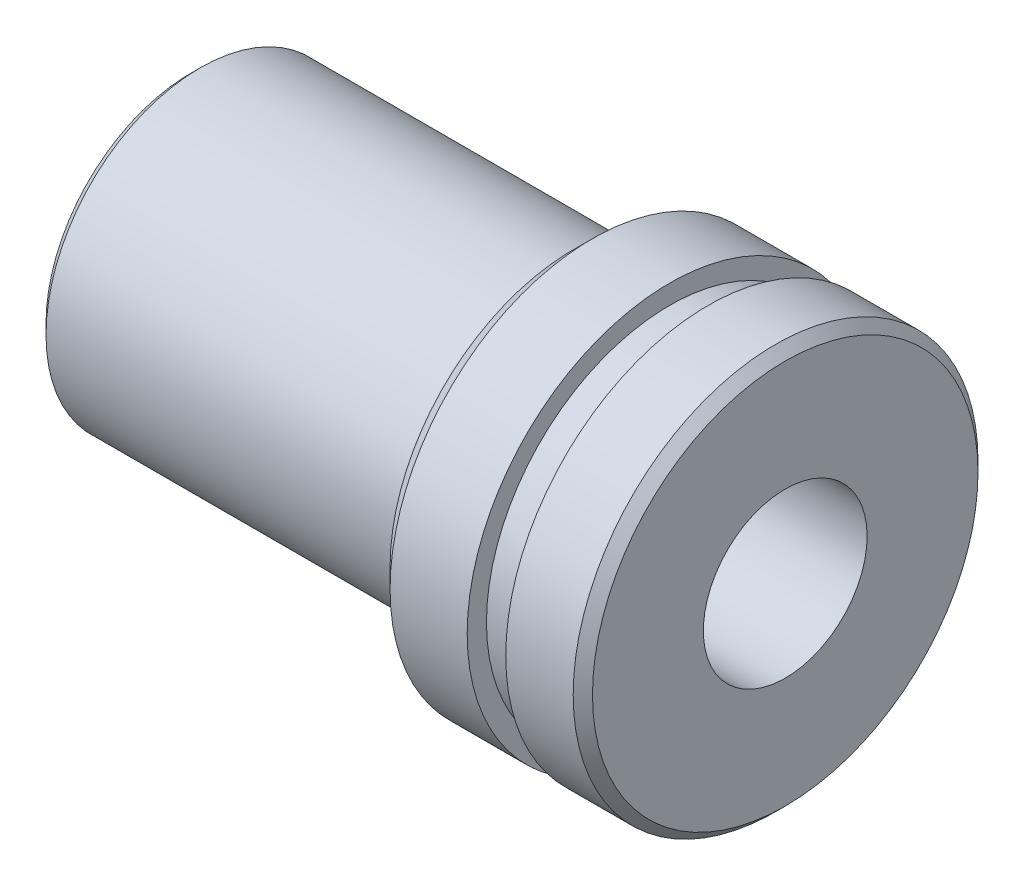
ISO-10303-21;
HEADER;
FILE_DESCRIPTION(('STEP AP214'),'2;1');
FILE_NAME('part.step','',(''),(''),'','','');
FILE_SCHEMA(('AUTOMOTIVE_DESIGN { 1 0 10303 214 1 1 1 1 }'));
ENDSEC;
DATA;
#1=APPLICATION_CONTEXT('core data for automotive mechanical design processes');
#2=APPLICATION_PROTOCOL_DEFINITION('international standard','automotive_design',2000,#1);
#3=PRODUCT_CONTEXT('',#1,'mechanical');
#4=PRODUCT('Part','Part','',(#3));
#5=PRODUCT_RELATED_PRODUCT_CATEGORY('part','',(#4));
#6=PRODUCT_DEFINITION_FORMATION('','',#4);
#7=PRODUCT_DEFINITION_CONTEXT('part definition',#1,'design');
#8=PRODUCT_DEFINITION('design','',#6,#7);
#9=PRODUCT_DEFINITION_SHAPE('','',#8);
#10=(LENGTH_UNIT() NAMED_UNIT(*) SI_UNIT(.MILLI.,.METRE.));
#11=(NAMED_UNIT(*) PLANE_ANGLE_UNIT() SI_UNIT($,.RADIAN.));
#12=(NAMED_UNIT(*) SI_UNIT($,.STERADIAN.) SOLID_ANGLE_UNIT());
#13=UNCERTAINTY_MEASURE_WITH_UNIT(LENGTH_MEASURE(1.E-05),#10,'distance_accuracy_value','');
#14=(GEOMETRIC_REPRESENTATION_CONTEXT(3) GLOBAL_UNCERTAINTY_ASSIGNED_CONTEXT((#13)) GLOBAL_UNIT_ASSIGNED_CONTEXT((#10,
#11,#12)) REPRESENTATION_CONTEXT('',''));
#15=CARTESIAN_POINT('',(0.,0.,0.));
#16=DIRECTION('',(0.,0.,1.));
#17=DIRECTION('',(1.,0.,0.));
#18=AXIS2_PLACEMENT_3D('',#15,#16,#17);
#19=CARTESIAN_POINT('',(0.,10.5,0.));
#20=DIRECTION('',(1.,0.,0.));
#21=DIRECTION('',(0.,0.,-1.));
#22=AXIS2_PLACEMENT_3D('',#19,#20,#21);
#23=PLANE('',#22);
#24=CARTESIAN_POINT('',(0.,0.,0.));
#25=DIRECTION('',(1.,0.,0.));
#26=DIRECTION('',(0.,0.,-1.));
#27=AXIS2_PLACEMENT_3D('',#24,#25,#26);
#28=CIRCLE('',#27,10.);
#29=CARTESIAN_POINT('',(0.,0.,-10.));
#30=VERTEX_POINT('',#29);
#31=EDGE_CURVE('E49',#30,#30,#28,.T.);
#32=ORIENTED_EDGE('',*,*,#31,.T.);
#33=EDGE_LOOP('',(#32));
#34=FACE_BOUND('',#33,.T.);
#35=CARTESIAN_POINT('',(0.,0.,0.));
#36=DIRECTION('',(1.,0.,0.));
#37=DIRECTION('',(0.,0.,-1.));
#38=AXIS2_PLACEMENT_3D('',#35,#36,#37);
#39=CIRCLE('',#38,4.25);
#40=CARTESIAN_POINT('',(0.,0.,-4.25));
#41=VERTEX_POINT('',#40);
#42=EDGE_CURVE('E58',#41,#41,#39,.T.);
#43=ORIENTED_EDGE('',*,*,#42,.F.);
#44=EDGE_LOOP('',(#43));
#45=FACE_BOUND('',#44,.T.);
#46=ADVANCED_FACE('F27',(#34,#45),#23,.T.);
#47=CARTESIAN_POINT('',(9.,0.,0.));
#48=DIRECTION('',(1.,0.,0.));
#49=DIRECTION('',(0.,0.,-1.));
#50=AXIS2_PLACEMENT_3D('',#47,#48,#49);
#51=CYLINDRICAL_SURFACE('',#50,4.25);
#52=CARTESIAN_POINT('',(-29.85,0.,0.));
#53=DIRECTION('',(-1.,0.,0.));
#54=DIRECTION('',(0.,0.,1.));
#55=AXIS2_PLACEMENT_3D('',#52,#53,#54);
#56=CIRCLE('',#55,4.25);
#57=CARTESIAN_POINT('',(-29.85,0.,4.25));
#58=VERTEX_POINT('',#57);
#59=EDGE_CURVE('E10',#58,#58,#56,.T.);
#60=ORIENTED_EDGE('',*,*,#59,.T.);
#61=EDGE_LOOP('',(#60));
#62=FACE_BOUND('',#61,.T.);
#63=ORIENTED_EDGE('',*,*,#42,.T.);
#64=EDGE_LOOP('',(#63));
#65=FACE_BOUND('',#64,.T.);
#66=ADVANCED_FACE('F95',(#62,#65),#51,.F.);
#67=CARTESIAN_POINT('',(-30.85,4.25,0.));
#68=DIRECTION('',(-1.,0.,0.));
#69=DIRECTION('',(0.,0.,1.));
#70=AXIS2_PLACEMENT_3D('',#67,#68,#69);
#71=PLANE('',#70);
#72=CARTESIAN_POINT('',(-30.85,0.,0.));
#73=DIRECTION('',(-1.,0.,0.));
#74=DIRECTION('',(0.,0.,1.));
#75=AXIS2_PLACEMENT_3D('',#72,#73,#74);
#76=CIRCLE('',#75,5.24999999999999);
#77=CARTESIAN_POINT('',(-30.85,0.,5.24999999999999));
#78=VERTEX_POINT('',#77);
#79=EDGE_CURVE('E33',#78,#78,#76,.F.);
#80=ORIENTED_EDGE('',*,*,#79,.T.);
#81=EDGE_LOOP('',(#80));
#82=FACE_BOUND('',#81,.T.);
#83=CARTESIAN_POINT('',(-30.85,0.,0.));
#84=DIRECTION('',(-1.,0.,0.));
#85=DIRECTION('',(0.,0.,1.));
#86=AXIS2_PLACEMENT_3D('',#83,#84,#85);
#87=CIRCLE('',#86,7.49999999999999);
#88=CARTESIAN_POINT('',(-30.85,0.,7.49999999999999));
#89=VERTEX_POINT('',#88);
#90=EDGE_CURVE('E37',#89,#89,#87,.T.);
#91=ORIENTED_EDGE('',*,*,#90,.T.);
#92=EDGE_LOOP('',(#91));
#93=FACE_BOUND('',#92,.T.);
#94=ADVANCED_FACE('F100',(#82,#93),#71,.T.);
#95=CARTESIAN_POINT('',(9.,0.,0.));
#96=DIRECTION('',(1.,0.,0.));
#97=DIRECTION('',(0.,0.,-1.));
#98=AXIS2_PLACEMENT_3D('',#95,#96,#97);
#99=CYLINDRICAL_SURFACE('',#98,7.99999999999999);
#100=CARTESIAN_POINT('',(-30.35,0.,0.));
#101=DIRECTION('',(-1.,0.,0.));
#102=DIRECTION('',(0.,0.,1.));
#103=AXIS2_PLACEMENT_3D('',#100,#101,#102);
#104=CIRCLE('',#103,7.99999999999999);
#105=CARTESIAN_POINT('',(-30.35,0.,7.99999999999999));
#106=VERTEX_POINT('',#105);
#107=EDGE_CURVE('E41',#106,#106,#104,.F.);
#108=ORIENTED_EDGE('',*,*,#107,.T.);
#109=EDGE_LOOP('',(#108));
#110=FACE_BOUND('',#109,.T.);
#111=CARTESIAN_POINT('',(-11.,0.,0.));
#112=DIRECTION('',(1.,0.,0.));
#113=DIRECTION('',(0.,0.,-1.));
#114=AXIS2_PLACEMENT_3D('',#111,#112,#113);
#115=CIRCLE('',#114,7.99999999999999);
#116=CARTESIAN_POINT('',(-11.,0.,-7.99999999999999));
#117=VERTEX_POINT('',#116);
#118=EDGE_CURVE('E61',#117,#117,#115,.T.);
#119=ORIENTED_EDGE('',*,*,#118,.F.);
#120=EDGE_LOOP('',(#119));
#121=FACE_BOUND('',#120,.T.);
#122=ADVANCED_FACE('F139',(#110,#121),#99,.T.);
#123=CARTESIAN_POINT('',(-11.,7.99999999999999,0.));
#124=DIRECTION('',(-1.,0.,0.));
#125=DIRECTION('',(0.,0.,1.));
#126=AXIS2_PLACEMENT_3D('',#123,#124,#125);
#127=PLANE('',#126);
#128=CARTESIAN_POINT('',(-11.,0.,0.));
#129=DIRECTION('',(-1.,0.,0.));
#130=DIRECTION('',(0.,0.,1.));
#131=AXIS2_PLACEMENT_3D('',#128,#129,#130);
#132=CIRCLE('',#131,9.5);
#133=CARTESIAN_POINT('',(-11.,0.,9.5));
#134=VERTEX_POINT('',#133);
#135=EDGE_CURVE('E52',#134,#134,#132,.T.);
#136=ORIENTED_EDGE('',*,*,#135,.T.);
#137=EDGE_LOOP('',(#136));
#138=FACE_BOUND('',#137,.T.);
#139=ORIENTED_EDGE('',*,*,#118,.T.);
#140=EDGE_LOOP('',(#139));
#141=FACE_BOUND('',#140,.T.);
#142=ADVANCED_FACE('F158',(#138,#141),#127,.T.);
#143=CARTESIAN_POINT('',(9.,0.,0.));
#144=DIRECTION('',(1.,0.,0.));
#145=DIRECTION('',(0.,0.,-1.));
#146=AXIS2_PLACEMENT_3D('',#143,#144,#145);
#147=CYLINDRICAL_SURFACE('',#146,10.5);
#148=CARTESIAN_POINT('',(-10.,0.,0.));
#149=DIRECTION('',(-1.,0.,0.));
#150=DIRECTION('',(0.,0.,1.));
#151=AXIS2_PLACEMENT_3D('',#148,#149,#150);
#152=CIRCLE('',#151,10.5);
#153=CARTESIAN_POINT('',(-10.,0.,10.5));
#154=VERTEX_POINT('',#153);
#155=EDGE_CURVE('E55',#154,#154,#152,.F.);
#156=ORIENTED_EDGE('',*,*,#155,.T.);
#157=EDGE_LOOP('',(#156));
#158=FACE_BOUND('',#157,.T.);
#159=CARTESIAN_POINT('',(-6.,0.,0.));
#160=DIRECTION('',(1.,0.,0.));
#161=DIRECTION('',(0.,0.,-1.));
#162=AXIS2_PLACEMENT_3D('',#159,#160,#161);
#163=CIRCLE('',#162,10.5);
#164=CARTESIAN_POINT('',(-6.,0.,-10.5));
#165=VERTEX_POINT('',#164);
#166=EDGE_CURVE('E64',#165,#165,#163,.T.);
#167=ORIENTED_EDGE('',*,*,#166,.F.);
#168=EDGE_LOOP('',(#167));
#169=FACE_BOUND('',#168,.T.);
#170=ADVANCED_FACE('F164',(#158,#169),#147,.T.);
#171=CARTESIAN_POINT('',(-6.,10.5,0.));
#172=DIRECTION('',(1.,0.,0.));
#173=DIRECTION('',(0.,0.,-1.));
#174=AXIS2_PLACEMENT_3D('',#171,#172,#173);
#175=PLANE('',#174);
#176=ORIENTED_EDGE('',*,*,#166,.T.);
#177=EDGE_LOOP('',(#176));
#178=FACE_BOUND('',#177,.T.);
#179=CARTESIAN_POINT('',(-6.,0.,0.));
#180=DIRECTION('',(1.,0.,0.));
#181=DIRECTION('',(0.,0.,-1.));
#182=AXIS2_PLACEMENT_3D('',#179,#180,#181);
#183=CIRCLE('',#182,9.5);
#184=CARTESIAN_POINT('',(-6.,0.,-9.5));
#185=VERTEX_POINT('',#184);
#186=EDGE_CURVE('E67',#185,#185,#183,.T.);
#187=ORIENTED_EDGE('',*,*,#186,.F.);
#188=EDGE_LOOP('',(#187));
#189=FACE_BOUND('',#188,.T.);
#190=ADVANCED_FACE('F91',(#178,#189),#175,.T.);
#191=CARTESIAN_POINT('',(9.,0.,0.));
#192=DIRECTION('',(1.,0.,0.));
#193=DIRECTION('',(0.,0.,-1.));
#194=AXIS2_PLACEMENT_3D('',#191,#192,#193);
#195=CYLINDRICAL_SURFACE('',#194,9.5);
#196=ORIENTED_EDGE('',*,*,#186,.T.);
#197=EDGE_LOOP('',(#196));
#198=FACE_BOUND('',#197,.T.);
#199=CARTESIAN_POINT('',(-4.,0.,0.));
#200=DIRECTION('',(1.,0.,0.));
#201=DIRECTION('',(0.,0.,-1.));
#202=AXIS2_PLACEMENT_3D('',#199,#200,#201);
#203=CIRCLE('',#202,9.5);
#204=CARTESIAN_POINT('',(-4.,0.,-9.5));
#205=VERTEX_POINT('',#204);
#206=EDGE_CURVE('E70',#205,#205,#203,.T.);
#207=ORIENTED_EDGE('',*,*,#206,.F.);
#208=EDGE_LOOP('',(#207));
#209=FACE_BOUND('',#208,.T.);
#210=ADVANCED_FACE('F81',(#198,#209),#195,.T.);
#211=CARTESIAN_POINT('',(-4.,9.5,0.));
#212=DIRECTION('',(-1.,0.,0.));
#213=DIRECTION('',(0.,0.,1.));
#214=AXIS2_PLACEMENT_3D('',#211,#212,#213);
#215=PLANE('',#214);
#216=ORIENTED_EDGE('',*,*,#206,.T.);
#217=EDGE_LOOP('',(#216));
#218=FACE_BOUND('',#217,.T.);
#219=CARTESIAN_POINT('',(-4.,0.,0.));
#220=DIRECTION('',(1.,0.,0.));
#221=DIRECTION('',(0.,0.,-1.));
#222=AXIS2_PLACEMENT_3D('',#219,#220,#221);
#223=CIRCLE('',#222,10.5);
#224=CARTESIAN_POINT('',(-4.,0.,-10.5));
#225=VERTEX_POINT('',#224);
#226=EDGE_CURVE('E73',#225,#225,#223,.T.);
#227=ORIENTED_EDGE('',*,*,#226,.F.);
#228=EDGE_LOOP('',(#227));
#229=FACE_BOUND('',#228,.T.);
#230=ADVANCED_FACE('F79',(#218,#229),#215,.T.);
#231=CARTESIAN_POINT('',(9.,0.,0.));
#232=DIRECTION('',(1.,0.,0.));
#233=DIRECTION('',(0.,0.,-1.));
#234=AXIS2_PLACEMENT_3D('',#231,#232,#233);
#235=CYLINDRICAL_SURFACE('',#234,10.5);
#236=CARTESIAN_POINT('',(-0.5,0.,0.));
#237=DIRECTION('',(1.,0.,0.));
#238=DIRECTION('',(0.,0.,-1.));
#239=AXIS2_PLACEMENT_3D('',#236,#237,#238);
#240=CIRCLE('',#239,10.5);
#241=CARTESIAN_POINT('',(-0.5,0.,-10.5));
#242=VERTEX_POINT('',#241);
#243=EDGE_CURVE('E46',#242,#242,#240,.F.);
#244=ORIENTED_EDGE('',*,*,#243,.T.);
#245=EDGE_LOOP('',(#244));
#246=FACE_BOUND('',#245,.T.);
#247=ORIENTED_EDGE('',*,*,#226,.T.);
#248=EDGE_LOOP('',(#247));
#249=FACE_BOUND('',#248,.T.);
#250=ADVANCED_FACE('F77',(#246,#249),#235,.T.);
#251=CARTESIAN_POINT('',(-10.,0.,0.));
#252=DIRECTION('',(1.,0.,0.));
#253=DIRECTION('',(0.,0.,-1.));
#254=AXIS2_PLACEMENT_3D('',#251,#252,#253);
#255=CONICAL_SURFACE('',#254,10.5,0.785398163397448);
#256=ORIENTED_EDGE('',*,*,#135,.F.);
#257=EDGE_LOOP('',(#256));
#258=FACE_BOUND('',#257,.T.);
#259=ORIENTED_EDGE('',*,*,#155,.F.);
#260=EDGE_LOOP('',(#259));
#261=FACE_BOUND('',#260,.T.);
#262=ADVANCED_FACE('F88',(#258,#261),#255,.T.);
#263=CARTESIAN_POINT('',(0.,0.,0.));
#264=DIRECTION('',(-1.,0.,0.));
#265=DIRECTION('',(0.,0.,1.));
#266=AXIS2_PLACEMENT_3D('',#263,#264,#265);
#267=CONICAL_SURFACE('',#266,10.,0.785398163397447);
#268=ORIENTED_EDGE('',*,*,#243,.F.);
#269=EDGE_LOOP('',(#268));
#270=FACE_BOUND('',#269,.T.);
#271=ORIENTED_EDGE('',*,*,#31,.F.);
#272=EDGE_LOOP('',(#271));
#273=FACE_BOUND('',#272,.T.);
#274=ADVANCED_FACE('F106',(#270,#273),#267,.T.);
#275=CARTESIAN_POINT('',(-30.35,0.,0.));
#276=DIRECTION('',(1.,0.,0.));
#277=DIRECTION('',(0.,0.,-1.));
#278=AXIS2_PLACEMENT_3D('',#275,#276,#277);
#279=CONICAL_SURFACE('',#278,7.99999999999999,0.785398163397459);
#280=ORIENTED_EDGE('',*,*,#90,.F.);
#281=EDGE_LOOP('',(#280));
#282=FACE_BOUND('',#281,.T.);
#283=ORIENTED_EDGE('',*,*,#107,.F.);
#284=EDGE_LOOP('',(#283));
#285=FACE_BOUND('',#284,.T.);
#286=ADVANCED_FACE('F108',(#282,#285),#279,.T.);
#287=CARTESIAN_POINT('',(-30.85,0.,0.));
#288=DIRECTION('',(-1.,0.,0.));
#289=DIRECTION('',(0.,0.,1.));
#290=AXIS2_PLACEMENT_3D('',#287,#288,#289);
#291=CONICAL_SURFACE('',#290,5.24999999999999,0.785398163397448);
#292=ORIENTED_EDGE('',*,*,#59,.F.);
#293=EDGE_LOOP('',(#292));
#294=FACE_BOUND('',#293,.T.);
#295=ORIENTED_EDGE('',*,*,#79,.F.);
#296=EDGE_LOOP('',(#295));
#297=FACE_BOUND('',#296,.T.);
#298=ADVANCED_FACE('F115',(#294,#297),#291,.F.);
#299=CLOSED_SHELL('',(#46,#66,#94,#122,#142,#170,#190,#210,#230,#250,#262,#274,#286,#298));
#300=MANIFOLD_SOLID_BREP('B2',#299);
#301=ADVANCED_BREP_SHAPE_REPRESENTATION('',(#18,#300),#14);
#302=SHAPE_DEFINITION_REPRESENTATION(#9,#301);
ENDSEC;
END-ISO-10303-21;
